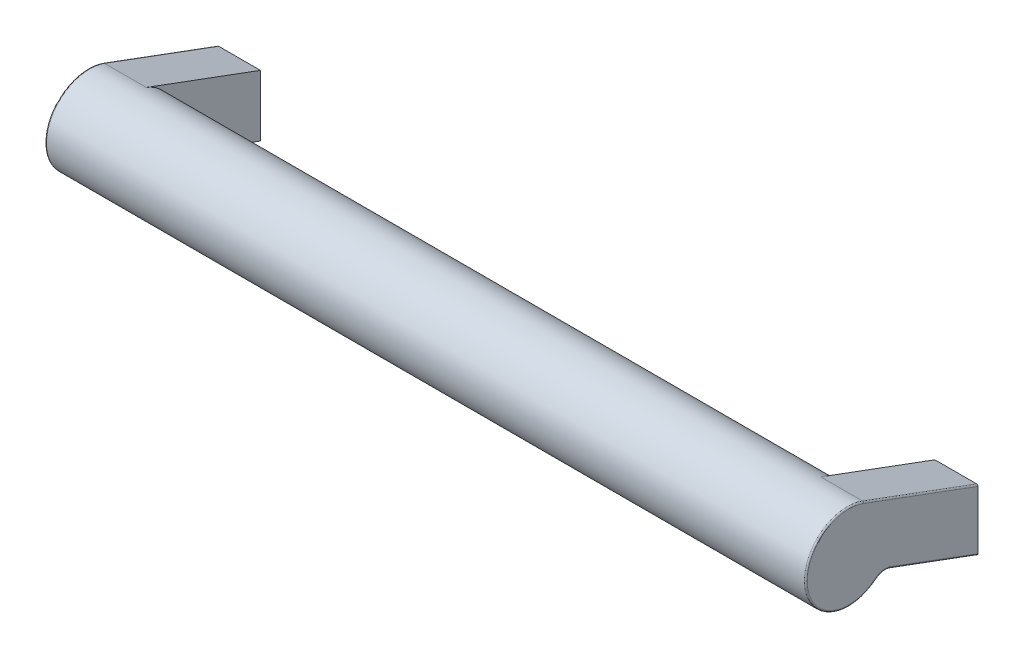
ISO-10303-21;
HEADER;
FILE_DESCRIPTION(('STEP AP214'),'2;1');
FILE_NAME('part.step','',(''),(''),'','','');
FILE_SCHEMA(('AUTOMOTIVE_DESIGN { 1 0 10303 214 1 1 1 1 }'));
ENDSEC;
DATA;
#1=APPLICATION_CONTEXT('core data for automotive mechanical design processes');
#2=APPLICATION_PROTOCOL_DEFINITION('international standard','automotive_design',2000,#1);
#3=PRODUCT_CONTEXT('',#1,'mechanical');
#4=PRODUCT('Part','Part','',(#3));
#5=PRODUCT_RELATED_PRODUCT_CATEGORY('part','',(#4));
#6=PRODUCT_DEFINITION_FORMATION('','',#4);
#7=PRODUCT_DEFINITION_CONTEXT('part definition',#1,'design');
#8=PRODUCT_DEFINITION('design','',#6,#7);
#9=PRODUCT_DEFINITION_SHAPE('','',#8);
#10=(LENGTH_UNIT() NAMED_UNIT(*) SI_UNIT(.MILLI.,.METRE.));
#11=(NAMED_UNIT(*) PLANE_ANGLE_UNIT() SI_UNIT($,.RADIAN.));
#12=(NAMED_UNIT(*) SI_UNIT($,.STERADIAN.) SOLID_ANGLE_UNIT());
#13=UNCERTAINTY_MEASURE_WITH_UNIT(LENGTH_MEASURE(1.E-05),#10,'distance_accuracy_value','');
#14=(GEOMETRIC_REPRESENTATION_CONTEXT(3) GLOBAL_UNCERTAINTY_ASSIGNED_CONTEXT((#13)) GLOBAL_UNIT_ASSIGNED_CONTEXT((#10,
#11,#12)) REPRESENTATION_CONTEXT('',''));
#15=CARTESIAN_POINT('',(0.,0.,0.));
#16=DIRECTION('',(0.,0.,1.));
#17=DIRECTION('',(1.,0.,0.));
#18=AXIS2_PLACEMENT_3D('',#15,#16,#17);
#19=CARTESIAN_POINT('',(142.5,11.,45.));
#20=DIRECTION('',(1.,0.,0.));
#21=DIRECTION('',(0.,1.,0.));
#22=AXIS2_PLACEMENT_3D('',#19,#20,#21);
#23=CYLINDRICAL_SURFACE('',#22,15.);
#24=CARTESIAN_POINT('',(7.5,11.,45.));
#25=DIRECTION('',(1.,0.,0.));
#26=DIRECTION('',(0.,1.,0.));
#27=AXIS2_PLACEMENT_3D('',#24,#25,#26);
#28=CIRCLE('',#27,15.);
#29=CARTESIAN_POINT('',(7.5,-0.545116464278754,35.4234512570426));
#30=VERTEX_POINT('',#29);
#31=CARTESIAN_POINT('',(7.5,25.0660927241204,39.7899102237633));
#32=VERTEX_POINT('',#31);
#33=EDGE_CURVE('E9',#30,#32,#28,.T.);
#34=ORIENTED_EDGE('',*,*,#33,.T.);
#35=DIRECTION('',(1.,0.,0.));
#36=VECTOR('',#35,1.);
#37=CARTESIAN_POINT('',(-7.5,25.0660927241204,39.7899102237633));
#38=LINE('',#37,#36);
#39=CARTESIAN_POINT('',(-7.,25.0660927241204,39.7899102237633));
#40=VERTEX_POINT('',#39);
#41=EDGE_CURVE('E373',#32,#40,#38,.F.);
#42=ORIENTED_EDGE('',*,*,#41,.T.);
#43=CARTESIAN_POINT('',(-7.,11.,45.));
#44=DIRECTION('',(1.,0.,0.));
#45=DIRECTION('',(0.,1.,0.));
#46=AXIS2_PLACEMENT_3D('',#43,#44,#45);
#47=CIRCLE('',#46,15.);
#48=CARTESIAN_POINT('',(-7.,-0.545116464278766,35.4234512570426));
#49=VERTEX_POINT('',#48);
#50=EDGE_CURVE('E354',#49,#40,#47,.F.);
#51=ORIENTED_EDGE('',*,*,#50,.F.);
#52=DIRECTION('',(1.,0.,0.));
#53=VECTOR('',#52,1.);
#54=CARTESIAN_POINT('',(-7.5,-0.545116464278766,35.4234512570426));
#55=LINE('',#54,#53);
#56=EDGE_CURVE('E372',#49,#30,#55,.T.);
#57=ORIENTED_EDGE('',*,*,#56,.T.);
#58=EDGE_LOOP('',(#34,#42,#51,#57));
#59=FACE_BOUND('',#58,.T.);
#60=DIRECTION('',(1.,0.,0.));
#61=VECTOR('',#60,1.);
#62=CARTESIAN_POINT('',(242.5,-0.545116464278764,35.4234512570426));
#63=LINE('',#62,#61);
#64=CARTESIAN_POINT('',(242.5,-0.545116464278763,35.4234512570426));
#65=VERTEX_POINT('',#64);
#66=CARTESIAN_POINT('',(257.,-0.545116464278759,35.4234512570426));
#67=VERTEX_POINT('',#66);
#68=EDGE_CURVE('E139',#65,#67,#63,.T.);
#69=ORIENTED_EDGE('',*,*,#68,.T.);
#70=CARTESIAN_POINT('',(257.,11.,45.));
#71=DIRECTION('',(1.,0.,0.));
#72=DIRECTION('',(0.,1.,0.));
#73=AXIS2_PLACEMENT_3D('',#70,#71,#72);
#74=CIRCLE('',#73,15.);
#75=CARTESIAN_POINT('',(257.,25.0660927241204,39.7899102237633));
#76=VERTEX_POINT('',#75);
#77=EDGE_CURVE('E166',#76,#67,#74,.T.);
#78=ORIENTED_EDGE('',*,*,#77,.F.);
#79=DIRECTION('',(1.,0.,0.));
#80=VECTOR('',#79,1.);
#81=CARTESIAN_POINT('',(242.5,25.0660927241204,39.7899102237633));
#82=LINE('',#81,#80);
#83=CARTESIAN_POINT('',(242.5,25.0660927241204,39.7899102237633));
#84=VERTEX_POINT('',#83);
#85=EDGE_CURVE('E142',#76,#84,#82,.F.);
#86=ORIENTED_EDGE('',*,*,#85,.T.);
#87=CARTESIAN_POINT('',(242.5,11.,45.));
#88=DIRECTION('',(1.,0.,0.));
#89=DIRECTION('',(0.,1.,0.));
#90=AXIS2_PLACEMENT_3D('',#87,#88,#89);
#91=CIRCLE('',#90,15.);
#92=EDGE_CURVE('E136',#65,#84,#91,.T.);
#93=ORIENTED_EDGE('',*,*,#92,.F.);
#94=EDGE_LOOP('',(#69,#78,#86,#93));
#95=FACE_BOUND('',#94,.T.);
#96=ADVANCED_FACE('F14',(#59,#95),#23,.T.);
#97=CARTESIAN_POINT('',(0.,0.,9.));
#98=DIRECTION('',(0.,0.,-1.));
#99=DIRECTION('',(1.,0.,0.));
#100=AXIS2_PLACEMENT_3D('',#97,#98,#99);
#101=PLANE('',#100);
#102=CARTESIAN_POINT('',(0.,0.,9.));
#103=DIRECTION('',(0.,0.,-1.));
#104=DIRECTION('',(1.,0.,0.));
#105=AXIS2_PLACEMENT_3D('',#102,#103,#104);
#106=CIRCLE('',#105,3.);
#107=CARTESIAN_POINT('',(3.,0.,9.));
#108=VERTEX_POINT('',#107);
#109=EDGE_CURVE('E208',#108,#108,#106,.T.);
#110=ORIENTED_EDGE('',*,*,#109,.T.);
#111=EDGE_LOOP('',(#110));
#112=FACE_BOUND('',#111,.T.);
#113=ADVANCED_FACE('F431',(#112),#101,.T.);
#114=CARTESIAN_POINT('',(-7.5,-4.39348861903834,32.2312683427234));
#115=DIRECTION('',(1.,0.,0.));
#116=DIRECTION('',(0.,1.,0.));
#117=AXIS2_PLACEMENT_3D('',#114,#115,#116);
#118=PLANE('',#117);
#119=CARTESIAN_POINT('',(-7.5,11.,45.));
#120=DIRECTION('',(1.,0.,0.));
#121=DIRECTION('',(0.,1.,0.));
#122=AXIS2_PLACEMENT_3D('',#119,#120,#121);
#123=CIRCLE('',#122,14.5);
#124=CARTESIAN_POINT('',(-7.5,25.5,45.));
#125=VERTEX_POINT('',#124);
#126=CARTESIAN_POINT('',(-7.5,-3.5,45.));
#127=VERTEX_POINT('',#126);
#128=EDGE_CURVE('E314',#125,#127,#123,.T.);
#129=ORIENTED_EDGE('',*,*,#128,.F.);
#130=CARTESIAN_POINT('',(-7.5,11.,45.));
#131=DIRECTION('',(1.,0.,0.));
#132=DIRECTION('',(0.,0.937739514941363,-0.347339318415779));
#133=AXIS2_PLACEMENT_3D('',#130,#131,#132);
#134=CIRCLE('',#133,14.5);
#135=CARTESIAN_POINT('',(-7.5,24.5972229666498,39.9635798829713));
#136=VERTEX_POINT('',#135);
#137=EDGE_CURVE('E302',#136,#125,#134,.T.);
#138=ORIENTED_EDGE('',*,*,#137,.F.);
#139=DIRECTION('',(0.,0.347339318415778,0.937739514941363));
#140=VECTOR('',#139,1.);
#141=CARTESIAN_POINT('',(-7.5,9.79468731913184,0.));
#142=LINE('',#141,#140);
#143=CARTESIAN_POINT('',(-7.5,9.79468731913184,0.));
#144=VERTEX_POINT('',#143);
#145=EDGE_CURVE('E328',#144,#136,#142,.T.);
#146=ORIENTED_EDGE('',*,*,#145,.F.);
#147=DIRECTION('',(0.,1.,0.));
#148=VECTOR('',#147,1.);
#149=CARTESIAN_POINT('',(-7.5,-4.39348861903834,0.));
#150=LINE('',#149,#148);
#151=CARTESIAN_POINT('',(-7.5,-10.466802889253,0.));
#152=VERTEX_POINT('',#151);
#153=EDGE_CURVE('E335',#152,#144,#150,.T.);
#154=ORIENTED_EDGE('',*,*,#153,.F.);
#155=DIRECTION('',(0.,-0.347339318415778,-0.937739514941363));
#156=VECTOR('',#155,1.);
#157=CARTESIAN_POINT('',(-7.5,0.764078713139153,30.3209020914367));
#158=LINE('',#157,#156);
#159=CARTESIAN_POINT('',(-7.5,0.764078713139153,30.3209020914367));
#160=VERTEX_POINT('',#159);
#161=EDGE_CURVE('E338',#160,#152,#158,.T.);
#162=ORIENTED_EDGE('',*,*,#161,.F.);
#163=CARTESIAN_POINT('',(-7.5,-4.39348861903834,32.2312683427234));
#164=DIRECTION('',(-1.,0.,0.));
#165=DIRECTION('',(0.,1.,0.));
#166=AXIS2_PLACEMENT_3D('',#163,#164,#165);
#167=CIRCLE('',#166,5.5);
#168=CARTESIAN_POINT('',(-7.5,1.10651138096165,32.2312683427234));
#169=VERTEX_POINT('',#168);
#170=EDGE_CURVE('E290',#169,#160,#167,.T.);
#171=ORIENTED_EDGE('',*,*,#170,.F.);
#172=CARTESIAN_POINT('',(-7.5,-4.39348861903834,32.2312683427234));
#173=DIRECTION('',(-1.,0.,0.));
#174=DIRECTION('',(0.,0.769674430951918,0.638436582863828));
#175=AXIS2_PLACEMENT_3D('',#172,#173,#174);
#176=CIRCLE('',#175,5.5);
#177=CARTESIAN_POINT('',(-7.5,-0.160279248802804,35.7426695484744));
#178=VERTEX_POINT('',#177);
#179=EDGE_CURVE('E249',#178,#169,#176,.T.);
#180=ORIENTED_EDGE('',*,*,#179,.F.);
#181=CARTESIAN_POINT('',(-7.5,11.,45.));
#182=DIRECTION('',(1.,0.,0.));
#183=DIRECTION('',(0.,-1.,0.));
#184=AXIS2_PLACEMENT_3D('',#181,#182,#183);
#185=CIRCLE('',#184,14.5);
#186=EDGE_CURVE('E21',#127,#178,#185,.T.);
#187=ORIENTED_EDGE('',*,*,#186,.F.);
#188=EDGE_LOOP('',(#129,#138,#146,#154,#162,#171,#180,#187));
#189=FACE_BOUND('',#188,.T.);
#190=ADVANCED_FACE('F268',(#189),#118,.F.);
#191=CARTESIAN_POINT('',(0.,0.,9.));
#192=DIRECTION('',(0.,0.,-1.));
#193=DIRECTION('',(1.,0.,0.));
#194=AXIS2_PLACEMENT_3D('',#191,#192,#193);
#195=CYLINDRICAL_SURFACE('',#194,3.);
#196=ORIENTED_EDGE('',*,*,#109,.F.);
#197=EDGE_LOOP('',(#196));
#198=FACE_BOUND('',#197,.T.);
#199=CARTESIAN_POINT('',(0.,0.,0.));
#200=DIRECTION('',(0.,0.,-1.));
#201=DIRECTION('',(1.,0.,0.));
#202=AXIS2_PLACEMENT_3D('',#199,#200,#201);
#203=CIRCLE('',#202,3.);
#204=CARTESIAN_POINT('',(3.,0.,0.));
#205=VERTEX_POINT('',#204);
#206=EDGE_CURVE('E205',#205,#205,#203,.T.);
#207=ORIENTED_EDGE('',*,*,#206,.T.);
#208=EDGE_LOOP('',(#207));
#209=FACE_BOUND('',#208,.T.);
#210=ADVANCED_FACE('F435',(#198,#209),#195,.F.);
#211=CARTESIAN_POINT('',(-7.,0.764078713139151,30.3209020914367));
#212=DIRECTION('',(0.,0.347339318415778,0.937739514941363));
#213=DIRECTION('',(0.,0.937739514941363,-0.347339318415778));
#214=AXIS2_PLACEMENT_3D('',#211,#212,#213);
#215=CYLINDRICAL_SURFACE('',#214,0.5);
#216=CARTESIAN_POINT('',(-7.,0.764078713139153,30.3209020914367));
#217=DIRECTION('',(0.,0.347339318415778,0.937739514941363));
#218=DIRECTION('',(0.,0.937739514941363,-0.347339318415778));
#219=AXIS2_PLACEMENT_3D('',#216,#217,#218);
#220=CIRCLE('',#219,0.5);
#221=CARTESIAN_POINT('',(-7.,0.29520895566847,30.4945717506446));
#222=VERTEX_POINT('',#221);
#223=EDGE_CURVE('E364',#222,#160,#220,.F.);
#224=ORIENTED_EDGE('',*,*,#223,.T.);
#225=ORIENTED_EDGE('',*,*,#161,.T.);
#226=CARTESIAN_POINT('',(-7.,-10.466802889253,0.));
#227=DIRECTION('',(0.,0.,1.));
#228=DIRECTION('',(0.,1.,0.));
#229=AXIS2_PLACEMENT_3D('',#226,#227,#228);
#230=ELLIPSE('',#229,0.53319711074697,0.5);
#231=CARTESIAN_POINT('',(-7.,-11.,0.));
#232=VERTEX_POINT('',#231);
#233=EDGE_CURVE('E366',#152,#232,#230,.T.);
#234=ORIENTED_EDGE('',*,*,#233,.T.);
#235=DIRECTION('',(0.,0.347339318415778,0.937739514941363));
#236=VECTOR('',#235,1.);
#237=CARTESIAN_POINT('',(-7.,0.295208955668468,30.4945717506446));
#238=LINE('',#237,#236);
#239=EDGE_CURVE('E217',#232,#222,#238,.T.);
#240=ORIENTED_EDGE('',*,*,#239,.T.);
#241=EDGE_LOOP('',(#224,#225,#234,#240));
#242=FACE_BOUND('',#241,.T.);
#243=ADVANCED_FACE('F226',(#242),#215,.T.);
#244=CARTESIAN_POINT('',(-7.,-4.39348861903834,32.2312683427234));
#245=DIRECTION('',(1.,0.,0.));
#246=DIRECTION('',(0.,1.,0.));
#247=AXIS2_PLACEMENT_3D('',#244,#245,#246);
#248=TOROIDAL_SURFACE('',#247,5.49999999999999,0.5);
#249=ORIENTED_EDGE('',*,*,#170,.T.);
#250=ORIENTED_EDGE('',*,*,#223,.F.);
#251=CARTESIAN_POINT('',(-7.,-4.39348861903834,32.2312683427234));
#252=DIRECTION('',(1.,0.,0.));
#253=DIRECTION('',(0.,1.,0.));
#254=AXIS2_PLACEMENT_3D('',#251,#252,#253);
#255=CIRCLE('',#254,5.);
#256=EDGE_CURVE('E382',#222,#49,#255,.T.);
#257=ORIENTED_EDGE('',*,*,#256,.T.);
#258=CARTESIAN_POINT('',(-7.,-0.160279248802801,35.7426695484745));
#259=DIRECTION('',(0.,0.638436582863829,-0.769674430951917));
#260=DIRECTION('',(0.,-0.769674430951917,-0.638436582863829));
#261=AXIS2_PLACEMENT_3D('',#258,#259,#260);
#262=CIRCLE('',#261,0.5);
#263=EDGE_CURVE('E347',#178,#49,#262,.F.);
#264=ORIENTED_EDGE('',*,*,#263,.F.);
#265=ORIENTED_EDGE('',*,*,#179,.T.);
#266=EDGE_LOOP('',(#249,#250,#257,#264,#265));
#267=FACE_BOUND('',#266,.T.);
#268=ADVANCED_FACE('F220',(#267),#248,.T.);
#269=CARTESIAN_POINT('',(-7.,18.5811294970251,23.7214550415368));
#270=DIRECTION('',(0.,-0.347339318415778,-0.937739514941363));
#271=DIRECTION('',(0.,-0.937739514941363,0.347339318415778));
#272=AXIS2_PLACEMENT_3D('',#269,#270,#271);
#273=CYLINDRICAL_SURFACE('',#272,0.5);
#274=CARTESIAN_POINT('',(-7.,9.79468731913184,0.));
#275=DIRECTION('',(0.,0.,1.));
#276=DIRECTION('',(0.,-1.,0.));
#277=AXIS2_PLACEMENT_3D('',#274,#275,#276);
#278=ELLIPSE('',#277,0.533197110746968,0.5);
#279=CARTESIAN_POINT('',(-7.,10.3278844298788,0.));
#280=VERTEX_POINT('',#279);
#281=EDGE_CURVE('E359',#280,#144,#278,.T.);
#282=ORIENTED_EDGE('',*,*,#281,.T.);
#283=ORIENTED_EDGE('',*,*,#145,.T.);
#284=CARTESIAN_POINT('',(-7.,24.5972229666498,39.9635798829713));
#285=DIRECTION('',(0.,0.347339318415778,0.937739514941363));
#286=DIRECTION('',(0.,0.937739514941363,-0.347339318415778));
#287=AXIS2_PLACEMENT_3D('',#284,#285,#286);
#288=CIRCLE('',#287,0.5);
#289=EDGE_CURVE('E355',#40,#136,#288,.T.);
#290=ORIENTED_EDGE('',*,*,#289,.F.);
#291=DIRECTION('',(0.,-0.347339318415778,-0.937739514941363));
#292=VECTOR('',#291,1.);
#293=CARTESIAN_POINT('',(-7.,19.0499992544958,23.547785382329));
#294=LINE('',#293,#292);
#295=EDGE_CURVE('E276',#40,#280,#294,.T.);
#296=ORIENTED_EDGE('',*,*,#295,.T.);
#297=EDGE_LOOP('',(#282,#283,#290,#296));
#298=FACE_BOUND('',#297,.T.);
#299=ADVANCED_FACE('F225',(#298),#273,.T.);
#300=CARTESIAN_POINT('',(-7.,11.,45.));
#301=DIRECTION('',(1.,0.,0.));
#302=DIRECTION('',(0.,1.,0.));
#303=AXIS2_PLACEMENT_3D('',#300,#301,#302);
#304=TOROIDAL_SURFACE('',#303,14.5,0.5);
#305=ORIENTED_EDGE('',*,*,#263,.T.);
#306=ORIENTED_EDGE('',*,*,#50,.T.);
#307=ORIENTED_EDGE('',*,*,#289,.T.);
#308=ORIENTED_EDGE('',*,*,#137,.T.);
#309=ORIENTED_EDGE('',*,*,#128,.T.);
#310=ORIENTED_EDGE('',*,*,#186,.T.);
#311=EDGE_LOOP('',(#305,#306,#307,#308,#309,#310));
#312=FACE_BOUND('',#311,.T.);
#313=ADVANCED_FACE('F256',(#312),#304,.T.);
#314=CARTESIAN_POINT('',(-7.5,10.3278844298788,0.));
#315=DIRECTION('',(0.,0.,1.));
#316=DIRECTION('',(-1.,0.,0.));
#317=AXIS2_PLACEMENT_3D('',#314,#315,#316);
#318=PLANE('',#317);
#319=ORIENTED_EDGE('',*,*,#206,.F.);
#320=EDGE_LOOP('',(#319));
#321=FACE_BOUND('',#320,.T.);
#322=ORIENTED_EDGE('',*,*,#281,.F.);
#323=DIRECTION('',(-1.,0.,0.));
#324=VECTOR('',#323,1.);
#325=CARTESIAN_POINT('',(-7.5,10.3278844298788,0.));
#326=LINE('',#325,#324);
#327=CARTESIAN_POINT('',(7.5,10.3278844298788,0.));
#328=VERTEX_POINT('',#327);
#329=EDGE_CURVE('E380',#328,#280,#326,.T.);
#330=ORIENTED_EDGE('',*,*,#329,.F.);
#331=DIRECTION('',(0.,-1.,0.));
#332=VECTOR('',#331,1.);
#333=CARTESIAN_POINT('',(7.5,10.3278844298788,0.));
#334=LINE('',#333,#332);
#335=CARTESIAN_POINT('',(7.5,-11.,0.));
#336=VERTEX_POINT('',#335);
#337=EDGE_CURVE('E377',#336,#328,#334,.F.);
#338=ORIENTED_EDGE('',*,*,#337,.F.);
#339=DIRECTION('',(-1.,0.,0.));
#340=VECTOR('',#339,1.);
#341=CARTESIAN_POINT('',(-7.5,-11.,0.));
#342=LINE('',#341,#340);
#343=EDGE_CURVE('E381',#232,#336,#342,.F.);
#344=ORIENTED_EDGE('',*,*,#343,.F.);
#345=ORIENTED_EDGE('',*,*,#233,.F.);
#346=ORIENTED_EDGE('',*,*,#153,.T.);
#347=EDGE_LOOP('',(#322,#330,#338,#344,#345,#346));
#348=FACE_BOUND('',#347,.T.);
#349=ADVANCED_FACE('F266',(#321,#348),#318,.F.);
#350=CARTESIAN_POINT('',(-7.5,-11.,0.));
#351=DIRECTION('',(0.,0.937739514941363,-0.347339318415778));
#352=DIRECTION('',(0.,-0.347339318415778,-0.937739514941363));
#353=AXIS2_PLACEMENT_3D('',#350,#351,#352);
#354=PLANE('',#353);
#355=ORIENTED_EDGE('',*,*,#239,.F.);
#356=ORIENTED_EDGE('',*,*,#343,.T.);
#357=DIRECTION('',(0.,-0.347339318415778,-0.937739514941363));
#358=VECTOR('',#357,1.);
#359=CARTESIAN_POINT('',(7.5,0.29520895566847,30.4945717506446));
#360=LINE('',#359,#358);
#361=CARTESIAN_POINT('',(7.5,0.29520895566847,30.4945717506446));
#362=VERTEX_POINT('',#361);
#363=EDGE_CURVE('E212',#362,#336,#360,.T.);
#364=ORIENTED_EDGE('',*,*,#363,.F.);
#365=DIRECTION('',(-1.,0.,0.));
#366=VECTOR('',#365,1.);
#367=CARTESIAN_POINT('',(-7.5,0.29520895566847,30.4945717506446));
#368=LINE('',#367,#366);
#369=EDGE_CURVE('E211',#222,#362,#368,.F.);
#370=ORIENTED_EDGE('',*,*,#369,.F.);
#371=EDGE_LOOP('',(#355,#356,#364,#370));
#372=FACE_BOUND('',#371,.T.);
#373=ADVANCED_FACE('F417',(#372),#354,.F.);
#374=CARTESIAN_POINT('',(-7.5,-4.39348861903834,32.2312683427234));
#375=DIRECTION('',(1.,0.,0.));
#376=DIRECTION('',(0.,1.,0.));
#377=AXIS2_PLACEMENT_3D('',#374,#375,#376);
#378=CYLINDRICAL_SURFACE('',#377,5.);
#379=ORIENTED_EDGE('',*,*,#256,.F.);
#380=ORIENTED_EDGE('',*,*,#369,.T.);
#381=CARTESIAN_POINT('',(7.5,-4.39348861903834,32.2312683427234));
#382=DIRECTION('',(1.,0.,0.));
#383=DIRECTION('',(0.,1.,0.));
#384=AXIS2_PLACEMENT_3D('',#381,#382,#383);
#385=CIRCLE('',#384,5.);
#386=EDGE_CURVE('E214',#30,#362,#385,.F.);
#387=ORIENTED_EDGE('',*,*,#386,.F.);
#388=ORIENTED_EDGE('',*,*,#56,.F.);
#389=EDGE_LOOP('',(#379,#380,#387,#388));
#390=FACE_BOUND('',#389,.T.);
#391=ADVANCED_FACE('F414',(#390),#378,.F.);
#392=CARTESIAN_POINT('',(-7.5,10.3278844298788,0.));
#393=DIRECTION('',(0.,-0.937739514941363,0.347339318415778));
#394=DIRECTION('',(0.,0.347339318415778,0.937739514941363));
#395=AXIS2_PLACEMENT_3D('',#392,#393,#394);
#396=PLANE('',#395);
#397=ORIENTED_EDGE('',*,*,#295,.F.);
#398=ORIENTED_EDGE('',*,*,#41,.F.);
#399=DIRECTION('',(0.,0.347339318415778,0.937739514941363));
#400=VECTOR('',#399,1.);
#401=CARTESIAN_POINT('',(7.5,10.3278844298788,0.));
#402=LINE('',#401,#400);
#403=EDGE_CURVE('E375',#328,#32,#402,.T.);
#404=ORIENTED_EDGE('',*,*,#403,.F.);
#405=ORIENTED_EDGE('',*,*,#329,.T.);
#406=EDGE_LOOP('',(#397,#398,#404,#405));
#407=FACE_BOUND('',#406,.T.);
#408=ADVANCED_FACE('F228',(#407),#396,.F.);
#409=CARTESIAN_POINT('',(7.5,-4.39348861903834,32.2312683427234));
#410=DIRECTION('',(1.,0.,0.));
#411=DIRECTION('',(0.,1.,0.));
#412=AXIS2_PLACEMENT_3D('',#409,#410,#411);
#413=PLANE('',#412);
#414=ORIENTED_EDGE('',*,*,#403,.T.);
#415=ORIENTED_EDGE('',*,*,#33,.F.);
#416=ORIENTED_EDGE('',*,*,#386,.T.);
#417=ORIENTED_EDGE('',*,*,#363,.T.);
#418=ORIENTED_EDGE('',*,*,#337,.T.);
#419=EDGE_LOOP('',(#414,#415,#416,#417,#418));
#420=FACE_BOUND('',#419,.T.);
#421=ADVANCED_FACE('F418',(#420),#413,.T.);
#422=CARTESIAN_POINT('',(250.,0.,9.));
#423=DIRECTION('',(0.,0.,-1.));
#424=DIRECTION('',(1.,0.,0.));
#425=AXIS2_PLACEMENT_3D('',#422,#423,#424);
#426=PLANE('',#425);
#427=CARTESIAN_POINT('',(250.,0.,9.));
#428=DIRECTION('',(0.,0.,-1.));
#429=DIRECTION('',(1.,0.,0.));
#430=AXIS2_PLACEMENT_3D('',#427,#428,#429);
#431=CIRCLE('',#430,3.);
#432=CARTESIAN_POINT('',(253.,0.,9.));
#433=VERTEX_POINT('',#432);
#434=EDGE_CURVE('E154',#433,#433,#431,.T.);
#435=ORIENTED_EDGE('',*,*,#434,.T.);
#436=EDGE_LOOP('',(#435));
#437=FACE_BOUND('',#436,.T.);
#438=ADVANCED_FACE('F420',(#437),#426,.T.);
#439=CARTESIAN_POINT('',(250.,0.,9.));
#440=DIRECTION('',(0.,0.,-1.));
#441=DIRECTION('',(1.,0.,0.));
#442=AXIS2_PLACEMENT_3D('',#439,#440,#441);
#443=CYLINDRICAL_SURFACE('',#442,3.);
#444=ORIENTED_EDGE('',*,*,#434,.F.);
#445=EDGE_LOOP('',(#444));
#446=FACE_BOUND('',#445,.T.);
#447=CARTESIAN_POINT('',(250.,0.,0.));
#448=DIRECTION('',(0.,0.,-1.));
#449=DIRECTION('',(1.,0.,0.));
#450=AXIS2_PLACEMENT_3D('',#447,#448,#449);
#451=CIRCLE('',#450,3.);
#452=CARTESIAN_POINT('',(253.,0.,0.));
#453=VERTEX_POINT('',#452);
#454=EDGE_CURVE('E202',#453,#453,#451,.T.);
#455=ORIENTED_EDGE('',*,*,#454,.T.);
#456=EDGE_LOOP('',(#455));
#457=FACE_BOUND('',#456,.T.);
#458=ADVANCED_FACE('F426',(#446,#457),#443,.F.);
#459=CARTESIAN_POINT('',(257.,-10.5311302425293,-0.173669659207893));
#460=DIRECTION('',(0.,-0.347339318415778,-0.937739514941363));
#461=DIRECTION('',(0.,-0.937739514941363,0.347339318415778));
#462=AXIS2_PLACEMENT_3D('',#459,#460,#461);
#463=CYLINDRICAL_SURFACE('',#462,0.5);
#464=CARTESIAN_POINT('',(257.,0.764078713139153,30.3209020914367));
#465=DIRECTION('',(0.,-0.347339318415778,-0.937739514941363));
#466=DIRECTION('',(0.,-0.937739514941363,0.347339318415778));
#467=AXIS2_PLACEMENT_3D('',#464,#465,#466);
#468=CIRCLE('',#467,0.5);
#469=CARTESIAN_POINT('',(257.5,0.764078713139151,30.3209020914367));
#470=VERTEX_POINT('',#469);
#471=CARTESIAN_POINT('',(257.,0.29520895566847,30.4945717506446));
#472=VERTEX_POINT('',#471);
#473=EDGE_CURVE('E162',#470,#472,#468,.T.);
#474=ORIENTED_EDGE('',*,*,#473,.T.);
#475=DIRECTION('',(0.,-0.347339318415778,-0.937739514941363));
#476=VECTOR('',#475,1.);
#477=CARTESIAN_POINT('',(257.,-11.,0.));
#478=LINE('',#477,#476);
#479=CARTESIAN_POINT('',(257.,-11.,0.));
#480=VERTEX_POINT('',#479);
#481=EDGE_CURVE('E198',#472,#480,#478,.T.);
#482=ORIENTED_EDGE('',*,*,#481,.T.);
#483=CARTESIAN_POINT('',(257.,-10.466802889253,0.));
#484=DIRECTION('',(0.,0.,1.));
#485=DIRECTION('',(0.,-1.,0.));
#486=AXIS2_PLACEMENT_3D('',#483,#484,#485);
#487=ELLIPSE('',#486,0.53319711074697,0.5);
#488=CARTESIAN_POINT('',(257.5,-10.466802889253,0.));
#489=VERTEX_POINT('',#488);
#490=EDGE_CURVE('E594',#480,#489,#487,.T.);
#491=ORIENTED_EDGE('',*,*,#490,.T.);
#492=DIRECTION('',(0.,-0.347339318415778,-0.937739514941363));
#493=VECTOR('',#492,1.);
#494=CARTESIAN_POINT('',(257.5,0.764078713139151,30.3209020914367));
#495=LINE('',#494,#493);
#496=EDGE_CURVE('E617',#470,#489,#495,.T.);
#497=ORIENTED_EDGE('',*,*,#496,.F.);
#498=EDGE_LOOP('',(#474,#482,#491,#497));
#499=FACE_BOUND('',#498,.T.);
#500=ADVANCED_FACE('F190',(#499),#463,.T.);
#501=CARTESIAN_POINT('',(242.5,10.3278844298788,0.));
#502=DIRECTION('',(0.,0.,1.));
#503=DIRECTION('',(-1.,0.,0.));
#504=AXIS2_PLACEMENT_3D('',#501,#502,#503);
#505=PLANE('',#504);
#506=ORIENTED_EDGE('',*,*,#454,.F.);
#507=EDGE_LOOP('',(#506));
#508=FACE_BOUND('',#507,.T.);
#509=ORIENTED_EDGE('',*,*,#490,.F.);
#510=DIRECTION('',(-1.,0.,0.));
#511=VECTOR('',#510,1.);
#512=CARTESIAN_POINT('',(242.5,-11.,0.));
#513=LINE('',#512,#511);
#514=CARTESIAN_POINT('',(242.5,-11.,0.));
#515=VERTEX_POINT('',#514);
#516=EDGE_CURVE('E593',#515,#480,#513,.F.);
#517=ORIENTED_EDGE('',*,*,#516,.F.);
#518=DIRECTION('',(0.,-1.,0.));
#519=VECTOR('',#518,1.);
#520=CARTESIAN_POINT('',(242.5,10.3278844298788,0.));
#521=LINE('',#520,#519);
#522=CARTESIAN_POINT('',(242.5,10.3278844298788,0.));
#523=VERTEX_POINT('',#522);
#524=EDGE_CURVE('E592',#523,#515,#521,.T.);
#525=ORIENTED_EDGE('',*,*,#524,.F.);
#526=DIRECTION('',(-1.,0.,0.));
#527=VECTOR('',#526,1.);
#528=CARTESIAN_POINT('',(242.5,10.3278844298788,0.));
#529=LINE('',#528,#527);
#530=CARTESIAN_POINT('',(257.,10.3278844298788,0.));
#531=VERTEX_POINT('',#530);
#532=EDGE_CURVE('E590',#531,#523,#529,.T.);
#533=ORIENTED_EDGE('',*,*,#532,.F.);
#534=CARTESIAN_POINT('',(257.,9.79468731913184,0.));
#535=DIRECTION('',(0.,0.,1.));
#536=DIRECTION('',(0.,1.,0.));
#537=AXIS2_PLACEMENT_3D('',#534,#535,#536);
#538=ELLIPSE('',#537,0.533197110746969,0.5);
#539=CARTESIAN_POINT('',(257.5,9.79468731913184,0.));
#540=VERTEX_POINT('',#539);
#541=EDGE_CURVE('E589',#540,#531,#538,.T.);
#542=ORIENTED_EDGE('',*,*,#541,.F.);
#543=DIRECTION('',(0.,1.,0.));
#544=VECTOR('',#543,1.);
#545=CARTESIAN_POINT('',(257.5,-4.39348861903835,0.));
#546=LINE('',#545,#544);
#547=EDGE_CURVE('E613',#489,#540,#546,.T.);
#548=ORIENTED_EDGE('',*,*,#547,.F.);
#549=EDGE_LOOP('',(#509,#517,#525,#533,#542,#548));
#550=FACE_BOUND('',#549,.T.);
#551=ADVANCED_FACE('F495',(#508,#550),#505,.F.);
#552=CARTESIAN_POINT('',(257.,9.85901467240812,0.173669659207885));
#553=DIRECTION('',(0.,0.347339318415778,0.937739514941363));
#554=DIRECTION('',(0.,0.937739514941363,-0.347339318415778));
#555=AXIS2_PLACEMENT_3D('',#552,#553,#554);
#556=CYLINDRICAL_SURFACE('',#555,0.5);
#557=CARTESIAN_POINT('',(257.,24.5972229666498,39.9635798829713));
#558=DIRECTION('',(0.,0.347339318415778,0.937739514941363));
#559=DIRECTION('',(0.,0.937739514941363,-0.347339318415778));
#560=AXIS2_PLACEMENT_3D('',#557,#558,#559);
#561=CIRCLE('',#560,0.5);
#562=CARTESIAN_POINT('',(257.5,24.5972229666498,39.9635798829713));
#563=VERTEX_POINT('',#562);
#564=EDGE_CURVE('E169',#563,#76,#561,.T.);
#565=ORIENTED_EDGE('',*,*,#564,.F.);
#566=DIRECTION('',(0.,0.347339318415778,0.937739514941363));
#567=VECTOR('',#566,1.);
#568=CARTESIAN_POINT('',(257.5,9.79468731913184,0.));
#569=LINE('',#568,#567);
#570=EDGE_CURVE('E618',#540,#563,#569,.T.);
#571=ORIENTED_EDGE('',*,*,#570,.F.);
#572=ORIENTED_EDGE('',*,*,#541,.T.);
#573=DIRECTION('',(0.,0.347339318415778,0.937739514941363));
#574=VECTOR('',#573,1.);
#575=CARTESIAN_POINT('',(257.,10.3278844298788,0.));
#576=LINE('',#575,#574);
#577=EDGE_CURVE('E586',#531,#76,#576,.T.);
#578=ORIENTED_EDGE('',*,*,#577,.T.);
#579=EDGE_LOOP('',(#565,#571,#572,#578));
#580=FACE_BOUND('',#579,.T.);
#581=ADVANCED_FACE('F504',(#580),#556,.T.);
#582=CARTESIAN_POINT('',(257.5,-4.39348861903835,32.2312683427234));
#583=DIRECTION('',(1.,0.,0.));
#584=DIRECTION('',(0.,1.,0.));
#585=AXIS2_PLACEMENT_3D('',#582,#583,#584);
#586=PLANE('',#585);
#587=CARTESIAN_POINT('',(257.5,11.,45.));
#588=DIRECTION('',(-1.,0.,0.));
#589=DIRECTION('',(0.,-1.,0.));
#590=AXIS2_PLACEMENT_3D('',#587,#588,#589);
#591=CIRCLE('',#590,14.5);
#592=CARTESIAN_POINT('',(257.5,25.5,45.));
#593=VERTEX_POINT('',#592);
#594=CARTESIAN_POINT('',(257.5,-3.5,45.));
#595=VERTEX_POINT('',#594);
#596=EDGE_CURVE('E655',#593,#595,#591,.F.);
#597=ORIENTED_EDGE('',*,*,#596,.T.);
#598=CARTESIAN_POINT('',(257.5,11.,45.));
#599=DIRECTION('',(-1.,0.,0.));
#600=DIRECTION('',(0.,-0.769674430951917,-0.638436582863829));
#601=AXIS2_PLACEMENT_3D('',#598,#599,#600);
#602=CIRCLE('',#601,14.5);
#603=CARTESIAN_POINT('',(257.5,-0.160279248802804,35.7426695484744));
#604=VERTEX_POINT('',#603);
#605=EDGE_CURVE('E145',#595,#604,#602,.F.);
#606=ORIENTED_EDGE('',*,*,#605,.T.);
#607=CARTESIAN_POINT('',(257.5,-4.39348861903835,32.2312683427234));
#608=DIRECTION('',(1.,0.,0.));
#609=DIRECTION('',(0.,1.,0.));
#610=AXIS2_PLACEMENT_3D('',#607,#608,#609);
#611=CIRCLE('',#610,5.5);
#612=CARTESIAN_POINT('',(257.5,1.10651138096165,32.2312683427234));
#613=VERTEX_POINT('',#612);
#614=EDGE_CURVE('E626',#604,#613,#611,.F.);
#615=ORIENTED_EDGE('',*,*,#614,.T.);
#616=CARTESIAN_POINT('',(257.5,-4.39348861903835,32.2312683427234));
#617=DIRECTION('',(1.,0.,0.));
#618=DIRECTION('',(0.,0.937739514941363,-0.347339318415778));
#619=AXIS2_PLACEMENT_3D('',#616,#617,#618);
#620=CIRCLE('',#619,5.5);
#621=EDGE_CURVE('E622',#613,#470,#620,.F.);
#622=ORIENTED_EDGE('',*,*,#621,.T.);
#623=ORIENTED_EDGE('',*,*,#496,.T.);
#624=ORIENTED_EDGE('',*,*,#547,.T.);
#625=ORIENTED_EDGE('',*,*,#570,.T.);
#626=CARTESIAN_POINT('',(257.5,11.,45.));
#627=DIRECTION('',(-1.,0.,0.));
#628=DIRECTION('',(0.,1.,0.));
#629=AXIS2_PLACEMENT_3D('',#626,#627,#628);
#630=CIRCLE('',#629,14.5);
#631=EDGE_CURVE('E634',#563,#593,#630,.F.);
#632=ORIENTED_EDGE('',*,*,#631,.T.);
#633=EDGE_LOOP('',(#597,#606,#615,#622,#623,#624,#625,#632));
#634=FACE_BOUND('',#633,.T.);
#635=ADVANCED_FACE('F188',(#634),#586,.T.);
#636=CARTESIAN_POINT('',(257.,-4.39348861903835,32.2312683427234));
#637=DIRECTION('',(1.,0.,0.));
#638=DIRECTION('',(0.,1.,0.));
#639=AXIS2_PLACEMENT_3D('',#636,#637,#638);
#640=TOROIDAL_SURFACE('',#639,5.5,0.5);
#641=CARTESIAN_POINT('',(257.,-4.39348861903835,32.2312683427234));
#642=DIRECTION('',(1.,0.,0.));
#643=DIRECTION('',(0.,1.,0.));
#644=AXIS2_PLACEMENT_3D('',#641,#642,#643);
#645=CIRCLE('',#644,5.);
#646=EDGE_CURVE('E158',#67,#472,#645,.F.);
#647=ORIENTED_EDGE('',*,*,#646,.T.);
#648=ORIENTED_EDGE('',*,*,#473,.F.);
#649=ORIENTED_EDGE('',*,*,#621,.F.);
#650=ORIENTED_EDGE('',*,*,#614,.F.);
#651=CARTESIAN_POINT('',(257.,-0.160279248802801,35.7426695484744));
#652=DIRECTION('',(0.,0.638436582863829,-0.769674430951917));
#653=DIRECTION('',(0.,-0.769674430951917,-0.638436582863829));
#654=AXIS2_PLACEMENT_3D('',#651,#652,#653);
#655=CIRCLE('',#654,0.5);
#656=EDGE_CURVE('E170',#67,#604,#655,.F.);
#657=ORIENTED_EDGE('',*,*,#656,.F.);
#658=EDGE_LOOP('',(#647,#648,#649,#650,#657));
#659=FACE_BOUND('',#658,.T.);
#660=ADVANCED_FACE('F176',(#659),#640,.T.);
#661=CARTESIAN_POINT('',(242.5,-11.,0.));
#662=DIRECTION('',(0.,0.937739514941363,-0.347339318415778));
#663=DIRECTION('',(0.,-0.347339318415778,-0.937739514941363));
#664=AXIS2_PLACEMENT_3D('',#661,#662,#663);
#665=PLANE('',#664);
#666=ORIENTED_EDGE('',*,*,#481,.F.);
#667=DIRECTION('',(-1.,0.,0.));
#668=VECTOR('',#667,1.);
#669=CARTESIAN_POINT('',(242.5,0.29520895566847,30.4945717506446));
#670=LINE('',#669,#668);
#671=CARTESIAN_POINT('',(242.5,0.29520895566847,30.4945717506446));
#672=VERTEX_POINT('',#671);
#673=EDGE_CURVE('E607',#672,#472,#670,.F.);
#674=ORIENTED_EDGE('',*,*,#673,.F.);
#675=DIRECTION('',(0.,-0.347339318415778,-0.937739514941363));
#676=VECTOR('',#675,1.);
#677=CARTESIAN_POINT('',(242.5,-11.,0.));
#678=LINE('',#677,#676);
#679=EDGE_CURVE('E151',#515,#672,#678,.F.);
#680=ORIENTED_EDGE('',*,*,#679,.F.);
#681=ORIENTED_EDGE('',*,*,#516,.T.);
#682=EDGE_LOOP('',(#666,#674,#680,#681));
#683=FACE_BOUND('',#682,.T.);
#684=ADVANCED_FACE('F187',(#683),#665,.F.);
#685=CARTESIAN_POINT('',(242.5,-4.39348861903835,32.2312683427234));
#686=DIRECTION('',(1.,0.,0.));
#687=DIRECTION('',(0.,1.,0.));
#688=AXIS2_PLACEMENT_3D('',#685,#686,#687);
#689=PLANE('',#688);
#690=CARTESIAN_POINT('',(242.5,-4.39348861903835,32.2312683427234));
#691=DIRECTION('',(1.,0.,0.));
#692=DIRECTION('',(0.,1.,0.));
#693=AXIS2_PLACEMENT_3D('',#690,#691,#692);
#694=CIRCLE('',#693,5.);
#695=EDGE_CURVE('E148',#65,#672,#694,.F.);
#696=ORIENTED_EDGE('',*,*,#695,.F.);
#697=ORIENTED_EDGE('',*,*,#92,.T.);
#698=DIRECTION('',(0.,0.347339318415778,0.937739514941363));
#699=VECTOR('',#698,1.);
#700=CARTESIAN_POINT('',(242.5,10.3278844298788,0.));
#701=LINE('',#700,#699);
#702=EDGE_CURVE('E160',#84,#523,#701,.F.);
#703=ORIENTED_EDGE('',*,*,#702,.T.);
#704=ORIENTED_EDGE('',*,*,#524,.T.);
#705=ORIENTED_EDGE('',*,*,#679,.T.);
#706=EDGE_LOOP('',(#696,#697,#703,#704,#705));
#707=FACE_BOUND('',#706,.T.);
#708=ADVANCED_FACE('F149',(#707),#689,.F.);
#709=CARTESIAN_POINT('',(242.5,10.3278844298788,0.));
#710=DIRECTION('',(0.,-0.937739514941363,0.347339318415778));
#711=DIRECTION('',(0.,0.347339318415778,0.937739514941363));
#712=AXIS2_PLACEMENT_3D('',#709,#710,#711);
#713=PLANE('',#712);
#714=ORIENTED_EDGE('',*,*,#577,.F.);
#715=ORIENTED_EDGE('',*,*,#532,.T.);
#716=ORIENTED_EDGE('',*,*,#702,.F.);
#717=ORIENTED_EDGE('',*,*,#85,.F.);
#718=EDGE_LOOP('',(#714,#715,#716,#717));
#719=FACE_BOUND('',#718,.T.);
#720=ADVANCED_FACE('F192',(#719),#713,.F.);
#721=CARTESIAN_POINT('',(257.,11.,45.));
#722=DIRECTION('',(1.,0.,0.));
#723=DIRECTION('',(0.,1.,0.));
#724=AXIS2_PLACEMENT_3D('',#721,#722,#723);
#725=TOROIDAL_SURFACE('',#724,14.5,0.5);
#726=ORIENTED_EDGE('',*,*,#656,.T.);
#727=ORIENTED_EDGE('',*,*,#605,.F.);
#728=ORIENTED_EDGE('',*,*,#596,.F.);
#729=ORIENTED_EDGE('',*,*,#631,.F.);
#730=ORIENTED_EDGE('',*,*,#564,.T.);
#731=ORIENTED_EDGE('',*,*,#77,.T.);
#732=EDGE_LOOP('',(#726,#727,#728,#729,#730,#731));
#733=FACE_BOUND('',#732,.T.);
#734=ADVANCED_FACE('F553',(#733),#725,.T.);
#735=CARTESIAN_POINT('',(242.5,-4.39348861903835,32.2312683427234));
#736=DIRECTION('',(1.,0.,0.));
#737=DIRECTION('',(0.,1.,0.));
#738=AXIS2_PLACEMENT_3D('',#735,#736,#737);
#739=CYLINDRICAL_SURFACE('',#738,5.);
#740=ORIENTED_EDGE('',*,*,#695,.T.);
#741=ORIENTED_EDGE('',*,*,#673,.T.);
#742=ORIENTED_EDGE('',*,*,#646,.F.);
#743=ORIENTED_EDGE('',*,*,#68,.F.);
#744=EDGE_LOOP('',(#740,#741,#742,#743));
#745=FACE_BOUND('',#744,.T.);
#746=ADVANCED_FACE('F156',(#745),#739,.F.);
#747=CLOSED_SHELL('',(#96,#113,#190,#210,#243,#268,#299,#313,#349,#373,#391,#408,#421,#438,#458,
#500,#551,#581,#635,#660,#684,#708,#720,#734,#746));
#748=MANIFOLD_SOLID_BREP('B1',#747);
#749=ADVANCED_BREP_SHAPE_REPRESENTATION('',(#18,#748),#14);
#750=SHAPE_DEFINITION_REPRESENTATION(#9,#749);
ENDSEC;
END-ISO-10303-21;
